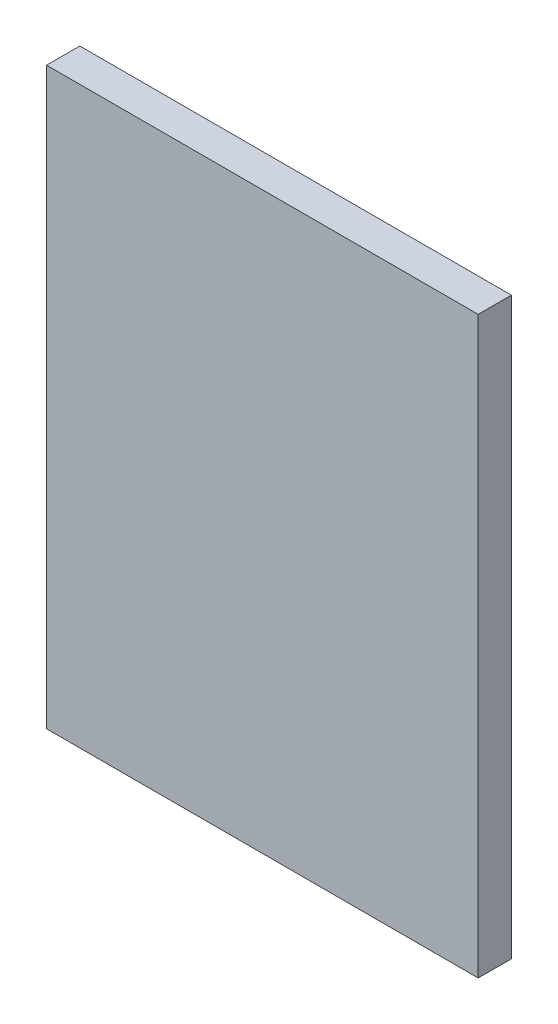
ISO-10303-21;
HEADER;
FILE_DESCRIPTION(('STEP AP214'),'2;1');
FILE_NAME('part.step','',(''),(''),'','','');
FILE_SCHEMA(('AUTOMOTIVE_DESIGN { 1 0 10303 214 1 1 1 1 }'));
ENDSEC;
DATA;
#1=APPLICATION_CONTEXT('core data for automotive mechanical design processes');
#2=APPLICATION_PROTOCOL_DEFINITION('international standard','automotive_design',2000,#1);
#3=PRODUCT_CONTEXT('',#1,'mechanical');
#4=PRODUCT('Part','Part','',(#3));
#5=PRODUCT_RELATED_PRODUCT_CATEGORY('part','',(#4));
#6=PRODUCT_DEFINITION_FORMATION('','',#4);
#7=PRODUCT_DEFINITION_CONTEXT('part definition',#1,'design');
#8=PRODUCT_DEFINITION('design','',#6,#7);
#9=PRODUCT_DEFINITION_SHAPE('','',#8);
#10=(LENGTH_UNIT() NAMED_UNIT(*) SI_UNIT(.MILLI.,.METRE.));
#11=(NAMED_UNIT(*) PLANE_ANGLE_UNIT() SI_UNIT($,.RADIAN.));
#12=(NAMED_UNIT(*) SI_UNIT($,.STERADIAN.) SOLID_ANGLE_UNIT());
#13=UNCERTAINTY_MEASURE_WITH_UNIT(LENGTH_MEASURE(1.E-05),#10,'distance_accuracy_value','');
#14=(GEOMETRIC_REPRESENTATION_CONTEXT(3) GLOBAL_UNCERTAINTY_ASSIGNED_CONTEXT((#13)) GLOBAL_UNIT_ASSIGNED_CONTEXT((#10,
#11,#12)) REPRESENTATION_CONTEXT('',''));
#15=CARTESIAN_POINT('',(0.,0.,0.));
#16=DIRECTION('',(0.,0.,1.));
#17=DIRECTION('',(1.,0.,0.));
#18=AXIS2_PLACEMENT_3D('',#15,#16,#17);
#19=CARTESIAN_POINT('',(0.,0.,16.));
#20=DIRECTION('',(1.,0.,0.));
#21=DIRECTION('',(0.,1.,0.));
#22=AXIS2_PLACEMENT_3D('',#19,#20,#21);
#23=PLANE('',#22);
#24=DIRECTION('',(0.,-1.,0.));
#25=VECTOR('',#24,1.);
#26=CARTESIAN_POINT('',(0.,0.,0.));
#27=LINE('',#26,#25);
#28=CARTESIAN_POINT('',(0.,0.,0.));
#29=VERTEX_POINT('',#28);
#30=CARTESIAN_POINT('',(0.,-277.,0.));
#31=VERTEX_POINT('',#30);
#32=EDGE_CURVE('E94',#29,#31,#27,.T.);
#33=ORIENTED_EDGE('',*,*,#32,.T.);
#34=DIRECTION('',(0.,0.,-1.));
#35=VECTOR('',#34,1.);
#36=CARTESIAN_POINT('',(0.,-277.,16.));
#37=LINE('',#36,#35);
#38=CARTESIAN_POINT('',(0.,-277.,16.));
#39=VERTEX_POINT('',#38);
#40=EDGE_CURVE('E11',#39,#31,#37,.T.);
#41=ORIENTED_EDGE('',*,*,#40,.F.);
#42=DIRECTION('',(0.,-1.,0.));
#43=VECTOR('',#42,1.);
#44=CARTESIAN_POINT('',(0.,0.,16.));
#45=LINE('',#44,#43);
#46=CARTESIAN_POINT('',(0.,0.,16.));
#47=VERTEX_POINT('',#46);
#48=EDGE_CURVE('E82',#47,#39,#45,.T.);
#49=ORIENTED_EDGE('',*,*,#48,.F.);
#50=DIRECTION('',(0.,0.,-1.));
#51=VECTOR('',#50,1.);
#52=CARTESIAN_POINT('',(0.,0.,16.));
#53=LINE('',#52,#51);
#54=EDGE_CURVE('E90',#47,#29,#53,.T.);
#55=ORIENTED_EDGE('',*,*,#54,.T.);
#56=EDGE_LOOP('',(#33,#41,#49,#55));
#57=FACE_BOUND('',#56,.T.);
#58=ADVANCED_FACE('F31',(#57),#23,.F.);
#59=CARTESIAN_POINT('',(0.,-277.,16.));
#60=DIRECTION('',(0.,1.,0.));
#61=DIRECTION('',(0.,0.,1.));
#62=AXIS2_PLACEMENT_3D('',#59,#60,#61);
#63=PLANE('',#62);
#64=DIRECTION('',(1.,0.,0.));
#65=VECTOR('',#64,1.);
#66=CARTESIAN_POINT('',(0.,-277.,0.));
#67=LINE('',#66,#65);
#68=CARTESIAN_POINT('',(208.,-277.,0.));
#69=VERTEX_POINT('',#68);
#70=EDGE_CURVE('E86',#31,#69,#67,.T.);
#71=ORIENTED_EDGE('',*,*,#70,.T.);
#72=DIRECTION('',(0.,0.,-1.));
#73=VECTOR('',#72,1.);
#74=CARTESIAN_POINT('',(208.,-277.,16.));
#75=LINE('',#74,#73);
#76=CARTESIAN_POINT('',(208.,-277.,16.));
#77=VERTEX_POINT('',#76);
#78=EDGE_CURVE('E39',#77,#69,#75,.T.);
#79=ORIENTED_EDGE('',*,*,#78,.F.);
#80=DIRECTION('',(1.,0.,0.));
#81=VECTOR('',#80,1.);
#82=CARTESIAN_POINT('',(0.,-277.,16.));
#83=LINE('',#82,#81);
#84=EDGE_CURVE('E77',#39,#77,#83,.T.);
#85=ORIENTED_EDGE('',*,*,#84,.F.);
#86=ORIENTED_EDGE('',*,*,#40,.T.);
#87=EDGE_LOOP('',(#71,#79,#85,#86));
#88=FACE_BOUND('',#87,.T.);
#89=ADVANCED_FACE('F85',(#88),#63,.F.);
#90=CARTESIAN_POINT('',(208.,0.,16.));
#91=DIRECTION('',(-1.,0.,0.));
#92=DIRECTION('',(0.,-1.,0.));
#93=AXIS2_PLACEMENT_3D('',#90,#91,#92);
#94=PLANE('',#93);
#95=DIRECTION('',(0.,1.,0.));
#96=VECTOR('',#95,1.);
#97=CARTESIAN_POINT('',(208.,0.,0.));
#98=LINE('',#97,#96);
#99=CARTESIAN_POINT('',(208.,0.,0.));
#100=VERTEX_POINT('',#99);
#101=EDGE_CURVE('E64',#69,#100,#98,.T.);
#102=ORIENTED_EDGE('',*,*,#101,.T.);
#103=DIRECTION('',(0.,0.,-1.));
#104=VECTOR('',#103,1.);
#105=CARTESIAN_POINT('',(208.,0.,16.));
#106=LINE('',#105,#104);
#107=CARTESIAN_POINT('',(208.,0.,16.));
#108=VERTEX_POINT('',#107);
#109=EDGE_CURVE('E87',#108,#100,#106,.T.);
#110=ORIENTED_EDGE('',*,*,#109,.F.);
#111=DIRECTION('',(0.,1.,0.));
#112=VECTOR('',#111,1.);
#113=CARTESIAN_POINT('',(208.,0.,16.));
#114=LINE('',#113,#112);
#115=EDGE_CURVE('E80',#77,#108,#114,.T.);
#116=ORIENTED_EDGE('',*,*,#115,.F.);
#117=ORIENTED_EDGE('',*,*,#78,.T.);
#118=EDGE_LOOP('',(#102,#110,#116,#117));
#119=FACE_BOUND('',#118,.T.);
#120=ADVANCED_FACE('F88',(#119),#94,.F.);
#121=CARTESIAN_POINT('',(0.,0.,16.));
#122=DIRECTION('',(0.,-1.,0.));
#123=DIRECTION('',(0.,0.,-1.));
#124=AXIS2_PLACEMENT_3D('',#121,#122,#123);
#125=PLANE('',#124);
#126=DIRECTION('',(-1.,0.,0.));
#127=VECTOR('',#126,1.);
#128=CARTESIAN_POINT('',(0.,0.,0.));
#129=LINE('',#128,#127);
#130=EDGE_CURVE('E70',#100,#29,#129,.T.);
#131=ORIENTED_EDGE('',*,*,#130,.T.);
#132=ORIENTED_EDGE('',*,*,#54,.F.);
#133=DIRECTION('',(-1.,0.,0.));
#134=VECTOR('',#133,1.);
#135=CARTESIAN_POINT('',(0.,0.,16.));
#136=LINE('',#135,#134);
#137=EDGE_CURVE('E47',#108,#47,#136,.T.);
#138=ORIENTED_EDGE('',*,*,#137,.F.);
#139=ORIENTED_EDGE('',*,*,#109,.T.);
#140=EDGE_LOOP('',(#131,#132,#138,#139));
#141=FACE_BOUND('',#140,.T.);
#142=ADVANCED_FACE('F101',(#141),#125,.F.);
#143=CARTESIAN_POINT('',(0.,-277.,16.));
#144=DIRECTION('',(0.,0.,1.));
#145=DIRECTION('',(1.,0.,0.));
#146=AXIS2_PLACEMENT_3D('',#143,#144,#145);
#147=PLANE('',#146);
#148=ORIENTED_EDGE('',*,*,#48,.T.);
#149=ORIENTED_EDGE('',*,*,#84,.T.);
#150=ORIENTED_EDGE('',*,*,#115,.T.);
#151=ORIENTED_EDGE('',*,*,#137,.T.);
#152=EDGE_LOOP('',(#148,#149,#150,#151));
#153=FACE_BOUND('',#152,.T.);
#154=ADVANCED_FACE('F78',(#153),#147,.T.);
#155=CARTESIAN_POINT('',(0.,-277.,0.));
#156=DIRECTION('',(0.,0.,1.));
#157=DIRECTION('',(1.,0.,0.));
#158=AXIS2_PLACEMENT_3D('',#155,#156,#157);
#159=PLANE('',#158);
#160=ORIENTED_EDGE('',*,*,#32,.F.);
#161=ORIENTED_EDGE('',*,*,#130,.F.);
#162=ORIENTED_EDGE('',*,*,#101,.F.);
#163=ORIENTED_EDGE('',*,*,#70,.F.);
#164=EDGE_LOOP('',(#160,#161,#162,#163));
#165=FACE_BOUND('',#164,.T.);
#166=ADVANCED_FACE('F104',(#165),#159,.F.);
#167=CLOSED_SHELL('',(#58,#89,#120,#142,#154,#166));
#168=MANIFOLD_SOLID_BREP('B2',#167);
#169=ADVANCED_BREP_SHAPE_REPRESENTATION('',(#18,#168),#14);
#170=SHAPE_DEFINITION_REPRESENTATION(#9,#169);
ENDSEC;
END-ISO-10303-21;
